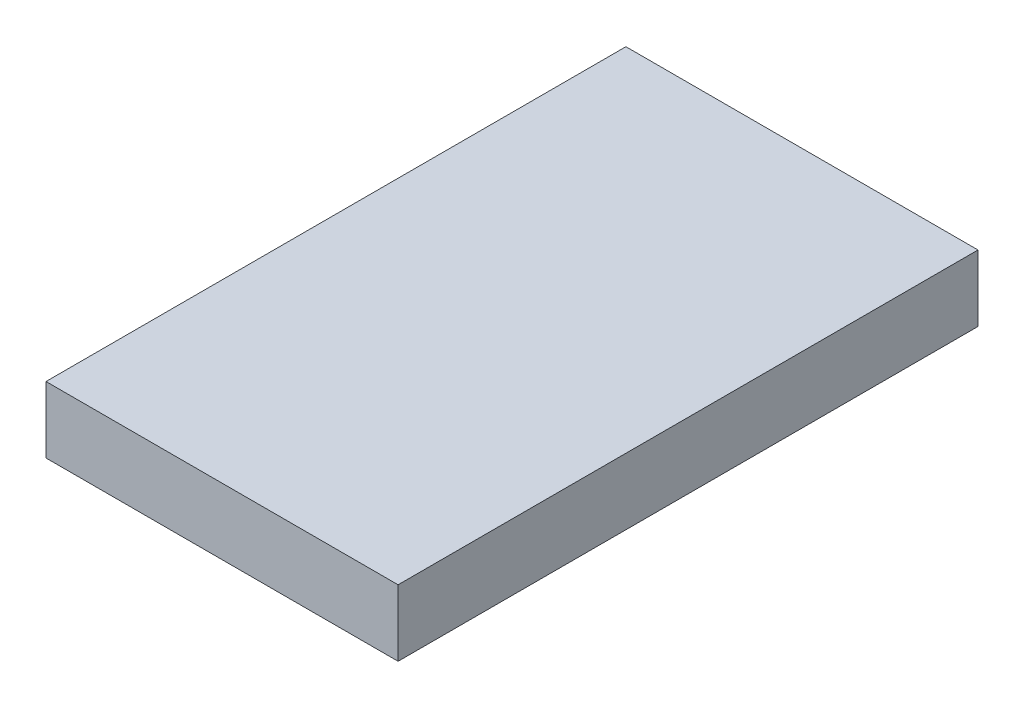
ISO-10303-21;
HEADER;
FILE_DESCRIPTION(('STEP AP214'),'2;1');
FILE_NAME('part.step','',(''),(''),'','','');
FILE_SCHEMA(('AUTOMOTIVE_DESIGN { 1 0 10303 214 1 1 1 1 }'));
ENDSEC;
DATA;
#1=APPLICATION_CONTEXT('core data for automotive mechanical design processes');
#2=APPLICATION_PROTOCOL_DEFINITION('international standard','automotive_design',2000,#1);
#3=PRODUCT_CONTEXT('',#1,'mechanical');
#4=PRODUCT('Part','Part','',(#3));
#5=PRODUCT_RELATED_PRODUCT_CATEGORY('part','',(#4));
#6=PRODUCT_DEFINITION_FORMATION('','',#4);
#7=PRODUCT_DEFINITION_CONTEXT('part definition',#1,'design');
#8=PRODUCT_DEFINITION('design','',#6,#7);
#9=PRODUCT_DEFINITION_SHAPE('','',#8);
#10=(LENGTH_UNIT() NAMED_UNIT(*) SI_UNIT(.MILLI.,.METRE.));
#11=(NAMED_UNIT(*) PLANE_ANGLE_UNIT() SI_UNIT($,.RADIAN.));
#12=(NAMED_UNIT(*) SI_UNIT($,.STERADIAN.) SOLID_ANGLE_UNIT());
#13=UNCERTAINTY_MEASURE_WITH_UNIT(LENGTH_MEASURE(1.E-05),#10,'distance_accuracy_value','');
#14=(GEOMETRIC_REPRESENTATION_CONTEXT(3) GLOBAL_UNCERTAINTY_ASSIGNED_CONTEXT((#13)) GLOBAL_UNIT_ASSIGNED_CONTEXT((#10,
#11,#12)) REPRESENTATION_CONTEXT('',''));
#15=CARTESIAN_POINT('',(0.,0.,0.));
#16=DIRECTION('',(0.,0.,1.));
#17=DIRECTION('',(1.,0.,0.));
#18=AXIS2_PLACEMENT_3D('',#15,#16,#17);
#19=CARTESIAN_POINT('',(-85.,0.,70.));
#20=DIRECTION('',(0.,1.,0.));
#21=DIRECTION('',(-1.,0.,0.));
#22=AXIS2_PLACEMENT_3D('',#19,#20,#21);
#23=PLANE('',#22);
#24=DIRECTION('',(1.,0.,0.));
#25=VECTOR('',#24,1.);
#26=CARTESIAN_POINT('',(-85.,0.,-70.));
#27=LINE('',#26,#25);
#28=CARTESIAN_POINT('',(-85.,0.,-70.));
#29=VERTEX_POINT('',#28);
#30=CARTESIAN_POINT('',(0.,0.,-70.));
#31=VERTEX_POINT('',#30);
#32=EDGE_CURVE('E94',#29,#31,#27,.T.);
#33=ORIENTED_EDGE('',*,*,#32,.T.);
#34=DIRECTION('',(0.,0.,-1.));
#35=VECTOR('',#34,1.);
#36=CARTESIAN_POINT('',(0.,0.,70.));
#37=LINE('',#36,#35);
#38=CARTESIAN_POINT('',(0.,0.,70.));
#39=VERTEX_POINT('',#38);
#40=EDGE_CURVE('E11',#39,#31,#37,.T.);
#41=ORIENTED_EDGE('',*,*,#40,.F.);
#42=DIRECTION('',(1.,0.,0.));
#43=VECTOR('',#42,1.);
#44=CARTESIAN_POINT('',(-85.,0.,70.));
#45=LINE('',#44,#43);
#46=CARTESIAN_POINT('',(-85.,0.,70.));
#47=VERTEX_POINT('',#46);
#48=EDGE_CURVE('E82',#47,#39,#45,.T.);
#49=ORIENTED_EDGE('',*,*,#48,.F.);
#50=DIRECTION('',(0.,0.,-1.));
#51=VECTOR('',#50,1.);
#52=CARTESIAN_POINT('',(-85.,0.,70.));
#53=LINE('',#52,#51);
#54=EDGE_CURVE('E90',#47,#29,#53,.T.);
#55=ORIENTED_EDGE('',*,*,#54,.T.);
#56=EDGE_LOOP('',(#33,#41,#49,#55));
#57=FACE_BOUND('',#56,.T.);
#58=ADVANCED_FACE('F31',(#57),#23,.F.);
#59=CARTESIAN_POINT('',(0.,0.,70.));
#60=DIRECTION('',(-1.,0.,0.));
#61=DIRECTION('',(0.,-1.,0.));
#62=AXIS2_PLACEMENT_3D('',#59,#60,#61);
#63=PLANE('',#62);
#64=DIRECTION('',(0.,1.,0.));
#65=VECTOR('',#64,1.);
#66=CARTESIAN_POINT('',(0.,0.,-70.));
#67=LINE('',#66,#65);
#68=CARTESIAN_POINT('',(0.,16.,-70.));
#69=VERTEX_POINT('',#68);
#70=EDGE_CURVE('E86',#31,#69,#67,.T.);
#71=ORIENTED_EDGE('',*,*,#70,.T.);
#72=DIRECTION('',(0.,0.,-1.));
#73=VECTOR('',#72,1.);
#74=CARTESIAN_POINT('',(0.,16.,70.));
#75=LINE('',#74,#73);
#76=CARTESIAN_POINT('',(0.,16.,70.));
#77=VERTEX_POINT('',#76);
#78=EDGE_CURVE('E39',#77,#69,#75,.T.);
#79=ORIENTED_EDGE('',*,*,#78,.F.);
#80=DIRECTION('',(0.,1.,0.));
#81=VECTOR('',#80,1.);
#82=CARTESIAN_POINT('',(0.,0.,70.));
#83=LINE('',#82,#81);
#84=EDGE_CURVE('E77',#39,#77,#83,.T.);
#85=ORIENTED_EDGE('',*,*,#84,.F.);
#86=ORIENTED_EDGE('',*,*,#40,.T.);
#87=EDGE_LOOP('',(#71,#79,#85,#86));
#88=FACE_BOUND('',#87,.T.);
#89=ADVANCED_FACE('F85',(#88),#63,.F.);
#90=CARTESIAN_POINT('',(0.,16.,70.));
#91=DIRECTION('',(0.,-1.,0.));
#92=DIRECTION('',(1.,0.,0.));
#93=AXIS2_PLACEMENT_3D('',#90,#91,#92);
#94=PLANE('',#93);
#95=DIRECTION('',(-1.,0.,0.));
#96=VECTOR('',#95,1.);
#97=CARTESIAN_POINT('',(0.,16.,-70.));
#98=LINE('',#97,#96);
#99=CARTESIAN_POINT('',(-85.,16.,-70.));
#100=VERTEX_POINT('',#99);
#101=EDGE_CURVE('E64',#69,#100,#98,.T.);
#102=ORIENTED_EDGE('',*,*,#101,.T.);
#103=DIRECTION('',(0.,0.,-1.));
#104=VECTOR('',#103,1.);
#105=CARTESIAN_POINT('',(-85.,16.,70.));
#106=LINE('',#105,#104);
#107=CARTESIAN_POINT('',(-85.,16.,70.));
#108=VERTEX_POINT('',#107);
#109=EDGE_CURVE('E87',#108,#100,#106,.T.);
#110=ORIENTED_EDGE('',*,*,#109,.F.);
#111=DIRECTION('',(-1.,0.,0.));
#112=VECTOR('',#111,1.);
#113=CARTESIAN_POINT('',(0.,16.,70.));
#114=LINE('',#113,#112);
#115=EDGE_CURVE('E80',#77,#108,#114,.T.);
#116=ORIENTED_EDGE('',*,*,#115,.F.);
#117=ORIENTED_EDGE('',*,*,#78,.T.);
#118=EDGE_LOOP('',(#102,#110,#116,#117));
#119=FACE_BOUND('',#118,.T.);
#120=ADVANCED_FACE('F88',(#119),#94,.F.);
#121=CARTESIAN_POINT('',(-85.,16.,70.));
#122=DIRECTION('',(1.,0.,0.));
#123=DIRECTION('',(0.,0.,-1.));
#124=AXIS2_PLACEMENT_3D('',#121,#122,#123);
#125=PLANE('',#124);
#126=DIRECTION('',(0.,-1.,0.));
#127=VECTOR('',#126,1.);
#128=CARTESIAN_POINT('',(-85.,16.,-70.));
#129=LINE('',#128,#127);
#130=EDGE_CURVE('E70',#100,#29,#129,.T.);
#131=ORIENTED_EDGE('',*,*,#130,.T.);
#132=ORIENTED_EDGE('',*,*,#54,.F.);
#133=DIRECTION('',(0.,-1.,0.));
#134=VECTOR('',#133,1.);
#135=CARTESIAN_POINT('',(-85.,16.,70.));
#136=LINE('',#135,#134);
#137=EDGE_CURVE('E47',#108,#47,#136,.T.);
#138=ORIENTED_EDGE('',*,*,#137,.F.);
#139=ORIENTED_EDGE('',*,*,#109,.T.);
#140=EDGE_LOOP('',(#131,#132,#138,#139));
#141=FACE_BOUND('',#140,.T.);
#142=ADVANCED_FACE('F101',(#141),#125,.F.);
#143=CARTESIAN_POINT('',(0.,0.,70.));
#144=DIRECTION('',(0.,0.,1.));
#145=DIRECTION('',(1.,0.,0.));
#146=AXIS2_PLACEMENT_3D('',#143,#144,#145);
#147=PLANE('',#146);
#148=ORIENTED_EDGE('',*,*,#48,.T.);
#149=ORIENTED_EDGE('',*,*,#84,.T.);
#150=ORIENTED_EDGE('',*,*,#115,.T.);
#151=ORIENTED_EDGE('',*,*,#137,.T.);
#152=EDGE_LOOP('',(#148,#149,#150,#151));
#153=FACE_BOUND('',#152,.T.);
#154=ADVANCED_FACE('F78',(#153),#147,.T.);
#155=CARTESIAN_POINT('',(0.,0.,-70.));
#156=DIRECTION('',(0.,0.,1.));
#157=DIRECTION('',(1.,0.,0.));
#158=AXIS2_PLACEMENT_3D('',#155,#156,#157);
#159=PLANE('',#158);
#160=ORIENTED_EDGE('',*,*,#32,.F.);
#161=ORIENTED_EDGE('',*,*,#130,.F.);
#162=ORIENTED_EDGE('',*,*,#101,.F.);
#163=ORIENTED_EDGE('',*,*,#70,.F.);
#164=EDGE_LOOP('',(#160,#161,#162,#163));
#165=FACE_BOUND('',#164,.T.);
#166=ADVANCED_FACE('F104',(#165),#159,.F.);
#167=CLOSED_SHELL('',(#58,#89,#120,#142,#154,#166));
#168=MANIFOLD_SOLID_BREP('B2',#167);
#169=ADVANCED_BREP_SHAPE_REPRESENTATION('',(#18,#168),#14);
#170=SHAPE_DEFINITION_REPRESENTATION(#9,#169);
ENDSEC;
END-ISO-10303-21;
